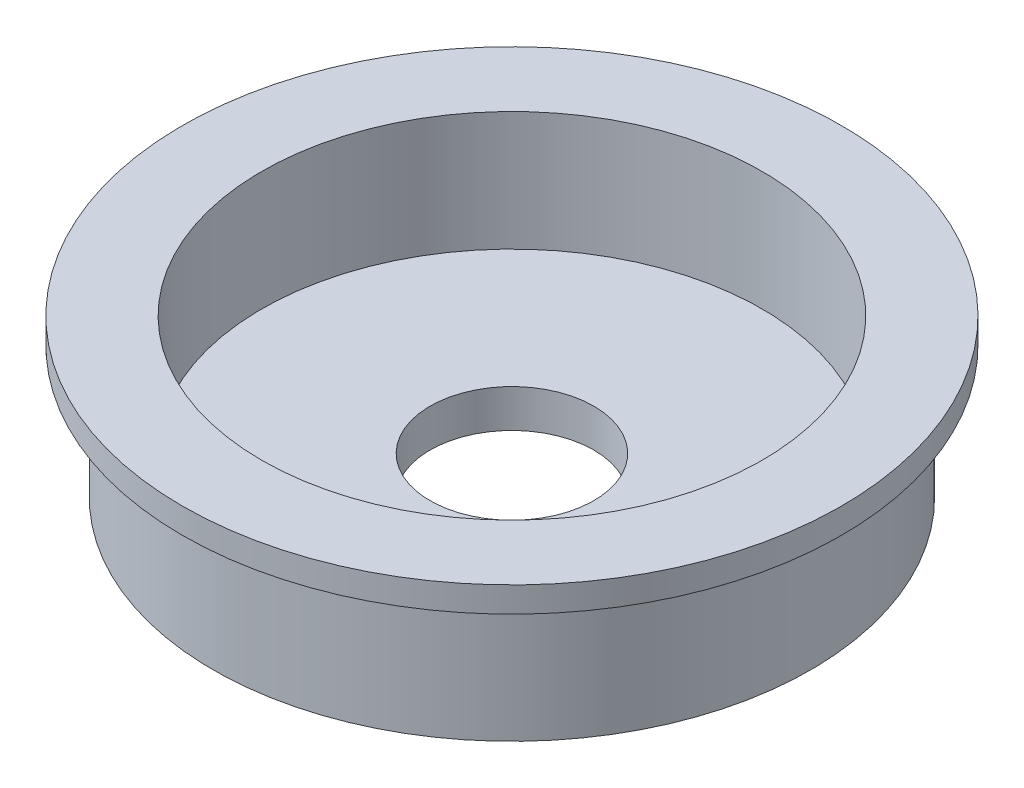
ISO-10303-21;
HEADER;
FILE_DESCRIPTION(('STEP AP214'),'2;1');
FILE_NAME('part.step','',(''),(''),'','','');
FILE_SCHEMA(('AUTOMOTIVE_DESIGN { 1 0 10303 214 1 1 1 1 }'));
ENDSEC;
DATA;
#1=APPLICATION_CONTEXT('core data for automotive mechanical design processes');
#2=APPLICATION_PROTOCOL_DEFINITION('international standard','automotive_design',2000,#1);
#3=PRODUCT_CONTEXT('',#1,'mechanical');
#4=PRODUCT('Part','Part','',(#3));
#5=PRODUCT_RELATED_PRODUCT_CATEGORY('part','',(#4));
#6=PRODUCT_DEFINITION_FORMATION('','',#4);
#7=PRODUCT_DEFINITION_CONTEXT('part definition',#1,'design');
#8=PRODUCT_DEFINITION('design','',#6,#7);
#9=PRODUCT_DEFINITION_SHAPE('','',#8);
#10=(LENGTH_UNIT() NAMED_UNIT(*) SI_UNIT(.MILLI.,.METRE.));
#11=(NAMED_UNIT(*) PLANE_ANGLE_UNIT() SI_UNIT($,.RADIAN.));
#12=(NAMED_UNIT(*) SI_UNIT($,.STERADIAN.) SOLID_ANGLE_UNIT());
#13=UNCERTAINTY_MEASURE_WITH_UNIT(LENGTH_MEASURE(1.E-05),#10,'distance_accuracy_value','');
#14=(GEOMETRIC_REPRESENTATION_CONTEXT(3) GLOBAL_UNCERTAINTY_ASSIGNED_CONTEXT((#13)) GLOBAL_UNIT_ASSIGNED_CONTEXT((#10,
#11,#12)) REPRESENTATION_CONTEXT('',''));
#15=CARTESIAN_POINT('',(0.,0.,0.));
#16=DIRECTION('',(0.,0.,1.));
#17=DIRECTION('',(1.,0.,0.));
#18=AXIS2_PLACEMENT_3D('',#15,#16,#17);
#19=CARTESIAN_POINT('',(0.,6.604,0.));
#20=DIRECTION('',(0.,-1.,0.));
#21=DIRECTION('',(0.,0.,-1.));
#22=AXIS2_PLACEMENT_3D('',#19,#20,#21);
#23=CYLINDRICAL_SURFACE('',#22,4.1021);
#24=CARTESIAN_POINT('',(0.,0.,0.));
#25=DIRECTION('',(0.,1.,0.));
#26=DIRECTION('',(0.,0.,1.));
#27=AXIS2_PLACEMENT_3D('',#24,#25,#26);
#28=CIRCLE('',#27,4.1021);
#29=CARTESIAN_POINT('',(0.,0.,-4.1021));
#30=VERTEX_POINT('',#29);
#31=EDGE_CURVE('E52',#30,#30,#28,.T.);
#32=CARTESIAN_POINT('',(0.,1.905,0.));
#33=DIRECTION('',(0.,1.,0.));
#34=DIRECTION('',(0.,0.,1.));
#35=AXIS2_PLACEMENT_3D('',#32,#33,#34);
#36=CIRCLE('',#35,4.1021);
#37=CARTESIAN_POINT('',(0.,1.905,-4.1021));
#38=VERTEX_POINT('',#37);
#39=EDGE_CURVE('E41',#38,#38,#36,.T.);
#40=CARTESIAN_POINT('',(0.,0.,-4.1021));
#41=CARTESIAN_POINT('',(0.,0.0198437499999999,-4.1021));
#42=CARTESIAN_POINT('',(0.,0.0396874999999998,-4.1021));
#43=CARTESIAN_POINT('',(0.,0.0793749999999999,-4.1021));
#44=CARTESIAN_POINT('',(0.,0.0992187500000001,-4.1021));
#45=CARTESIAN_POINT('',(0.,0.13890625,-4.1021));
#46=CARTESIAN_POINT('',(0.,0.15875,-4.1021));
#47=CARTESIAN_POINT('',(0.,0.1984375,-4.1021));
#48=CARTESIAN_POINT('',(0.,0.21828125,-4.1021));
#49=CARTESIAN_POINT('',(0.,0.25796875,-4.1021));
#50=CARTESIAN_POINT('',(0.,0.2778125,-4.1021));
#51=CARTESIAN_POINT('',(0.,0.3175,-4.1021));
#52=CARTESIAN_POINT('',(0.,0.33734375,-4.1021));
#53=CARTESIAN_POINT('',(0.,0.37703125,-4.1021));
#54=CARTESIAN_POINT('',(0.,0.396875,-4.1021));
#55=CARTESIAN_POINT('',(0.,0.436562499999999,-4.1021));
#56=CARTESIAN_POINT('',(0.,0.456406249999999,-4.1021));
#57=CARTESIAN_POINT('',(0.,0.496093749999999,-4.1021));
#58=CARTESIAN_POINT('',(0.,0.5159375,-4.1021));
#59=CARTESIAN_POINT('',(0.,0.555625,-4.1021));
#60=CARTESIAN_POINT('',(0.,0.57546875,-4.1021));
#61=CARTESIAN_POINT('',(0.,0.61515625,-4.1021));
#62=CARTESIAN_POINT('',(0.,0.635,-4.1021));
#63=CARTESIAN_POINT('',(0.,0.6746875,-4.1021));
#64=CARTESIAN_POINT('',(0.,0.69453125,-4.1021));
#65=CARTESIAN_POINT('',(0.,0.73421875,-4.1021));
#66=CARTESIAN_POINT('',(0.,0.7540625,-4.1021));
#67=CARTESIAN_POINT('',(0.,0.793749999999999,-4.1021));
#68=CARTESIAN_POINT('',(0.,0.813593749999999,-4.1021));
#69=CARTESIAN_POINT('',(0.,0.853281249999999,-4.1021));
#70=CARTESIAN_POINT('',(0.,0.873124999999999,-4.1021));
#71=CARTESIAN_POINT('',(0.,0.9128125,-4.1021));
#72=CARTESIAN_POINT('',(0.,0.932656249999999,-4.1021));
#73=CARTESIAN_POINT('',(0.,0.972343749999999,-4.1021));
#74=CARTESIAN_POINT('',(0.,0.992187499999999,-4.1021));
#75=CARTESIAN_POINT('',(0.,1.031875,-4.1021));
#76=CARTESIAN_POINT('',(0.,1.05171875,-4.1021));
#77=CARTESIAN_POINT('',(0.,1.09140625,-4.1021));
#78=CARTESIAN_POINT('',(0.,1.11125,-4.1021));
#79=CARTESIAN_POINT('',(0.,1.1509375,-4.1021));
#80=CARTESIAN_POINT('',(0.,1.17078125,-4.1021));
#81=CARTESIAN_POINT('',(0.,1.21046875,-4.1021));
#82=CARTESIAN_POINT('',(0.,1.2303125,-4.1021));
#83=CARTESIAN_POINT('',(0.,1.27,-4.1021));
#84=CARTESIAN_POINT('',(0.,1.28984375,-4.1021));
#85=CARTESIAN_POINT('',(0.,1.32953125,-4.1021));
#86=CARTESIAN_POINT('',(0.,1.349375,-4.1021));
#87=CARTESIAN_POINT('',(0.,1.3890625,-4.1021));
#88=CARTESIAN_POINT('',(0.,1.40890625,-4.1021));
#89=CARTESIAN_POINT('',(0.,1.44859375,-4.1021));
#90=CARTESIAN_POINT('',(0.,1.4684375,-4.1021));
#91=CARTESIAN_POINT('',(0.,1.508125,-4.1021));
#92=CARTESIAN_POINT('',(0.,1.52796875,-4.1021));
#93=CARTESIAN_POINT('',(0.,1.56765625,-4.1021));
#94=CARTESIAN_POINT('',(0.,1.5875,-4.1021));
#95=CARTESIAN_POINT('',(0.,1.6271875,-4.1021));
#96=CARTESIAN_POINT('',(0.,1.64703125,-4.1021));
#97=CARTESIAN_POINT('',(0.,1.68671875,-4.1021));
#98=CARTESIAN_POINT('',(0.,1.7065625,-4.1021));
#99=CARTESIAN_POINT('',(0.,1.74625,-4.1021));
#100=CARTESIAN_POINT('',(0.,1.76609375,-4.1021));
#101=CARTESIAN_POINT('',(0.,1.80578125,-4.1021));
#102=CARTESIAN_POINT('',(0.,1.825625,-4.1021));
#103=CARTESIAN_POINT('',(0.,1.8653125,-4.1021));
#104=CARTESIAN_POINT('',(0.,1.88515625,-4.1021));
#105=CARTESIAN_POINT('',(0.,1.905,-4.1021));
#106=B_SPLINE_CURVE_WITH_KNOTS('',3,(#40,#41,#42,#43,#44,#45,#46,#47,#48,#49,#50,#51,#52,#53,
#54,#55,#56,#57,#58,#59,#60,#61,#62,#63,#64,#65,#66,#67,#68,#69,#70,#71,#72,#73,#74,#75,#76,#77,
#78,#79,#80,#81,#82,#83,#84,#85,#86,#87,#88,#89,#90,#91,#92,#93,#94,#95,#96,#97,#98,#99,#100,
#101,#102,#103,#104,#105),.UNSPECIFIED.,.F.,.F.,(4,2,2,2,2,2,2,2,2,2,2,2,2,2,2,2,2,2,2,2,2,2,2,
2,2,2,2,2,2,2,2,2,4),(0.,0.0595312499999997,0.1190625,0.17859375,0.238125,0.29765625,0.3571875,
0.41671875,0.476249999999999,0.53578125,0.595312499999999,0.65484375,0.714375,0.773906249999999,
0.833437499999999,0.89296875,0.952499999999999,1.01203125,1.0715625,1.13109375,1.190625,
1.25015625,1.3096875,1.36921875,1.42875,1.48828125,1.5478125,1.60734375,1.666875,1.72640625,
1.7859375,1.84546875,1.905),.UNSPECIFIED.);
#107=EDGE_CURVE('BSEAM37',#30,#38,#106,.T.);
#108=ORIENTED_EDGE('',*,*,#31,.F.);
#109=ORIENTED_EDGE('',*,*,#39,.T.);
#110=ORIENTED_EDGE('',*,*,#107,.T.);
#111=ORIENTED_EDGE('',*,*,#107,.F.);
#112=EDGE_LOOP('',(#108,#110,#109,#111));
#113=FACE_BOUND('',#112,.T.);
#114=ADVANCED_FACE('F37',(#113),#23,.F.);
#115=CARTESIAN_POINT('',(0.,0.,0.));
#116=DIRECTION('',(0.,1.,0.));
#117=DIRECTION('',(0.,0.,1.));
#118=AXIS2_PLACEMENT_3D('',#115,#116,#117);
#119=PLANE('',#118);
#120=CARTESIAN_POINT('',(0.,0.,0.));
#121=DIRECTION('',(0.,1.,0.));
#122=DIRECTION('',(0.,0.,1.));
#123=AXIS2_PLACEMENT_3D('',#120,#121,#122);
#124=CIRCLE('',#123,14.9733);
#125=CARTESIAN_POINT('',(0.,0.,-14.9733));
#126=VERTEX_POINT('',#125);
#127=EDGE_CURVE('E46',#126,#126,#124,.T.);
#128=ORIENTED_EDGE('',*,*,#127,.F.);
#129=EDGE_LOOP('',(#128));
#130=FACE_BOUND('',#129,.T.);
#131=ORIENTED_EDGE('',*,*,#31,.T.);
#132=EDGE_LOOP('',(#131));
#133=FACE_BOUND('',#132,.T.);
#134=ADVANCED_FACE('F90',(#130,#133),#119,.F.);
#135=CARTESIAN_POINT('',(0.,6.604,0.));
#136=DIRECTION('',(0.,-1.,0.));
#137=DIRECTION('',(0.,0.,-1.));
#138=AXIS2_PLACEMENT_3D('',#135,#136,#137);
#139=CYLINDRICAL_SURFACE('',#138,14.9733);
#140=CARTESIAN_POINT('',(0.,6.604,0.));
#141=DIRECTION('',(0.,1.,0.));
#142=DIRECTION('',(0.,0.,1.));
#143=AXIS2_PLACEMENT_3D('',#140,#141,#142);
#144=CIRCLE('',#143,14.9733);
#145=CARTESIAN_POINT('',(0.,6.604,-14.9733));
#146=VERTEX_POINT('',#145);
#147=EDGE_CURVE('E10',#146,#146,#144,.T.);
#148=CARTESIAN_POINT('',(0.,6.604,-14.9733));
#149=CARTESIAN_POINT('',(0.,6.53520833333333,-14.9733));
#150=CARTESIAN_POINT('',(0.,6.46641666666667,-14.9733));
#151=CARTESIAN_POINT('',(0.,6.32883333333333,-14.9733));
#152=CARTESIAN_POINT('',(0.,6.26004166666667,-14.9733));
#153=CARTESIAN_POINT('',(0.,6.12245833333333,-14.9733));
#154=CARTESIAN_POINT('',(0.,6.05366666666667,-14.9733));
#155=CARTESIAN_POINT('',(0.,5.91608333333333,-14.9733));
#156=CARTESIAN_POINT('',(0.,5.84729166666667,-14.9733));
#157=CARTESIAN_POINT('',(0.,5.70970833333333,-14.9733));
#158=CARTESIAN_POINT('',(0.,5.64091666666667,-14.9733));
#159=CARTESIAN_POINT('',(0.,5.50333333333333,-14.9733));
#160=CARTESIAN_POINT('',(0.,5.43454166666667,-14.9733));
#161=CARTESIAN_POINT('',(0.,5.29695833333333,-14.9733));
#162=CARTESIAN_POINT('',(0.,5.22816666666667,-14.9733));
#163=CARTESIAN_POINT('',(0.,5.09058333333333,-14.9733));
#164=CARTESIAN_POINT('',(0.,5.02179166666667,-14.9733));
#165=CARTESIAN_POINT('',(0.,4.88420833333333,-14.9733));
#166=CARTESIAN_POINT('',(0.,4.81541666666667,-14.9733));
#167=CARTESIAN_POINT('',(0.,4.67783333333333,-14.9733));
#168=CARTESIAN_POINT('',(0.,4.60904166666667,-14.9733));
#169=CARTESIAN_POINT('',(0.,4.47145833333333,-14.9733));
#170=CARTESIAN_POINT('',(0.,4.40266666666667,-14.9733));
#171=CARTESIAN_POINT('',(0.,4.26508333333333,-14.9733));
#172=CARTESIAN_POINT('',(0.,4.19629166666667,-14.9733));
#173=CARTESIAN_POINT('',(0.,4.05870833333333,-14.9733));
#174=CARTESIAN_POINT('',(0.,3.98991666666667,-14.9733));
#175=CARTESIAN_POINT('',(0.,3.85233333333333,-14.9733));
#176=CARTESIAN_POINT('',(0.,3.78354166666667,-14.9733));
#177=CARTESIAN_POINT('',(0.,3.64595833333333,-14.9733));
#178=CARTESIAN_POINT('',(0.,3.57716666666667,-14.9733));
#179=CARTESIAN_POINT('',(0.,3.43958333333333,-14.9733));
#180=CARTESIAN_POINT('',(0.,3.37079166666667,-14.9733));
#181=CARTESIAN_POINT('',(0.,3.23320833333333,-14.9733));
#182=CARTESIAN_POINT('',(0.,3.16441666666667,-14.9733));
#183=CARTESIAN_POINT('',(0.,3.02683333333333,-14.9733));
#184=CARTESIAN_POINT('',(0.,2.95804166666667,-14.9733));
#185=CARTESIAN_POINT('',(0.,2.82045833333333,-14.9733));
#186=CARTESIAN_POINT('',(0.,2.75166666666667,-14.9733));
#187=CARTESIAN_POINT('',(0.,2.61408333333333,-14.9733));
#188=CARTESIAN_POINT('',(0.,2.54529166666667,-14.9733));
#189=CARTESIAN_POINT('',(0.,2.40770833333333,-14.9733));
#190=CARTESIAN_POINT('',(0.,2.33891666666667,-14.9733));
#191=CARTESIAN_POINT('',(0.,2.20133333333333,-14.9733));
#192=CARTESIAN_POINT('',(0.,2.13254166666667,-14.9733));
#193=CARTESIAN_POINT('',(0.,1.99495833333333,-14.9733));
#194=CARTESIAN_POINT('',(0.,1.92616666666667,-14.9733));
#195=CARTESIAN_POINT('',(0.,1.78858333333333,-14.9733));
#196=CARTESIAN_POINT('',(0.,1.71979166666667,-14.9733));
#197=CARTESIAN_POINT('',(0.,1.58220833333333,-14.9733));
#198=CARTESIAN_POINT('',(0.,1.51341666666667,-14.9733));
#199=CARTESIAN_POINT('',(0.,1.37583333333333,-14.9733));
#200=CARTESIAN_POINT('',(0.,1.30704166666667,-14.9733));
#201=CARTESIAN_POINT('',(0.,1.16945833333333,-14.9733));
#202=CARTESIAN_POINT('',(0.,1.10066666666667,-14.9733));
#203=CARTESIAN_POINT('',(0.,0.963083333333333,-14.9733));
#204=CARTESIAN_POINT('',(0.,0.894291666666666,-14.9733));
#205=CARTESIAN_POINT('',(0.,0.756708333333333,-14.9733));
#206=CARTESIAN_POINT('',(0.,0.687916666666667,-14.9733));
#207=CARTESIAN_POINT('',(0.,0.550333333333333,-14.9733));
#208=CARTESIAN_POINT('',(0.,0.481541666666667,-14.9733));
#209=CARTESIAN_POINT('',(0.,0.343958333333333,-14.9733));
#210=CARTESIAN_POINT('',(0.,0.275166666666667,-14.9733));
#211=CARTESIAN_POINT('',(0.,0.137583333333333,-14.9733));
#212=CARTESIAN_POINT('',(0.,0.0687916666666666,-14.9733));
#213=CARTESIAN_POINT('',(0.,0.,-14.9733));
#214=B_SPLINE_CURVE_WITH_KNOTS('',3,(#148,#149,#150,#151,#152,#153,#154,#155,#156,#157,#158,
#159,#160,#161,#162,#163,#164,#165,#166,#167,#168,#169,#170,#171,#172,#173,#174,#175,#176,#177,
#178,#179,#180,#181,#182,#183,#184,#185,#186,#187,#188,#189,#190,#191,#192,#193,#194,#195,#196,
#197,#198,#199,#200,#201,#202,#203,#204,#205,#206,#207,#208,#209,#210,#211,#212,#213),
.UNSPECIFIED.,.F.,.F.,(4,2,2,2,2,2,2,2,2,2,2,2,2,2,2,2,2,2,2,2,2,2,2,2,2,2,2,2,2,2,2,2,4),(0.,
0.206375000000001,0.412750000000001,0.619125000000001,0.825500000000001,1.031875,1.23825,
1.444625,1.651,1.857375,2.06375,2.270125,2.4765,2.682875,2.88925,3.095625,3.302,3.508375,
3.71475,3.921125,4.1275,4.333875,4.54025,4.746625,4.953,5.159375,5.36575,5.572125,5.7785,
5.984875,6.19125,6.397625,6.604),.UNSPECIFIED.);
#215=EDGE_CURVE('BSEAM39',#146,#126,#214,.T.);
#216=ORIENTED_EDGE('',*,*,#147,.F.);
#217=ORIENTED_EDGE('',*,*,#127,.T.);
#218=ORIENTED_EDGE('',*,*,#215,.T.);
#219=ORIENTED_EDGE('',*,*,#215,.F.);
#220=EDGE_LOOP('',(#216,#218,#217,#219));
#221=FACE_BOUND('',#220,.T.);
#222=ADVANCED_FACE('F39',(#221),#139,.T.);
#223=CARTESIAN_POINT('',(0.,7.874,0.));
#224=DIRECTION('',(0.,1.,0.));
#225=DIRECTION('',(0.,0.,1.));
#226=AXIS2_PLACEMENT_3D('',#223,#224,#225);
#227=PLANE('',#226);
#228=CARTESIAN_POINT('',(0.,7.874,0.));
#229=DIRECTION('',(0.,1.,0.));
#230=DIRECTION('',(0.,0.,1.));
#231=AXIS2_PLACEMENT_3D('',#228,#229,#230);
#232=CIRCLE('',#231,12.5349);
#233=CARTESIAN_POINT('',(0.,7.874,12.5349));
#234=VERTEX_POINT('',#233);
#235=EDGE_CURVE('E65',#234,#234,#232,.T.);
#236=ORIENTED_EDGE('',*,*,#235,.F.);
#237=EDGE_LOOP('',(#236));
#238=FACE_BOUND('',#237,.T.);
#239=CARTESIAN_POINT('',(0.,7.874,0.));
#240=DIRECTION('',(0.,1.,0.));
#241=DIRECTION('',(0.,0.,1.));
#242=AXIS2_PLACEMENT_3D('',#239,#240,#241);
#243=CIRCLE('',#242,16.51);
#244=CARTESIAN_POINT('',(0.,7.874,16.51));
#245=VERTEX_POINT('',#244);
#246=EDGE_CURVE('E57',#245,#245,#243,.T.);
#247=ORIENTED_EDGE('',*,*,#246,.T.);
#248=EDGE_LOOP('',(#247));
#249=FACE_BOUND('',#248,.T.);
#250=ADVANCED_FACE('F105',(#238,#249),#227,.T.);
#251=CARTESIAN_POINT('',(0.,6.604,0.));
#252=DIRECTION('',(0.,1.,0.));
#253=DIRECTION('',(0.,0.,1.));
#254=AXIS2_PLACEMENT_3D('',#251,#252,#253);
#255=PLANE('',#254);
#256=ORIENTED_EDGE('',*,*,#147,.T.);
#257=EDGE_LOOP('',(#256));
#258=FACE_BOUND('',#257,.T.);
#259=CARTESIAN_POINT('',(0.,6.604,0.));
#260=DIRECTION('',(0.,1.,0.));
#261=DIRECTION('',(0.,0.,1.));
#262=AXIS2_PLACEMENT_3D('',#259,#260,#261);
#263=CIRCLE('',#262,16.51);
#264=CARTESIAN_POINT('',(0.,6.604,16.51));
#265=VERTEX_POINT('',#264);
#266=EDGE_CURVE('E58',#265,#265,#263,.T.);
#267=ORIENTED_EDGE('',*,*,#266,.F.);
#268=EDGE_LOOP('',(#267));
#269=FACE_BOUND('',#268,.T.);
#270=ADVANCED_FACE('F101',(#258,#269),#255,.F.);
#271=CARTESIAN_POINT('',(0.,7.874,0.));
#272=DIRECTION('',(0.,-1.,0.));
#273=DIRECTION('',(0.,0.,-1.));
#274=AXIS2_PLACEMENT_3D('',#271,#272,#273);
#275=CYLINDRICAL_SURFACE('',#274,16.51);
#276=ORIENTED_EDGE('',*,*,#246,.F.);
#277=EDGE_LOOP('',(#276));
#278=FACE_BOUND('',#277,.T.);
#279=ORIENTED_EDGE('',*,*,#266,.T.);
#280=EDGE_LOOP('',(#279));
#281=FACE_BOUND('',#280,.T.);
#282=ADVANCED_FACE('F86',(#278,#281),#275,.T.);
#283=CARTESIAN_POINT('',(0.,1.905,0.));
#284=DIRECTION('',(0.,1.,0.));
#285=DIRECTION('',(0.,0.,1.));
#286=AXIS2_PLACEMENT_3D('',#283,#284,#285);
#287=CYLINDRICAL_SURFACE('',#286,12.5349);
#288=CARTESIAN_POINT('',(0.,1.905,0.));
#289=DIRECTION('',(0.,1.,0.));
#290=DIRECTION('',(0.,0.,1.));
#291=AXIS2_PLACEMENT_3D('',#288,#289,#290);
#292=CIRCLE('',#291,12.5349);
#293=CARTESIAN_POINT('',(0.,1.905,12.5349));
#294=VERTEX_POINT('',#293);
#295=EDGE_CURVE('E69',#294,#294,#292,.T.);
#296=ORIENTED_EDGE('',*,*,#295,.F.);
#297=EDGE_LOOP('',(#296));
#298=FACE_BOUND('',#297,.T.);
#299=ORIENTED_EDGE('',*,*,#235,.T.);
#300=EDGE_LOOP('',(#299));
#301=FACE_BOUND('',#300,.T.);
#302=ADVANCED_FACE('F81',(#298,#301),#287,.F.);
#303=CARTESIAN_POINT('',(0.,1.905,0.));
#304=DIRECTION('',(0.,1.,0.));
#305=DIRECTION('',(0.,0.,1.));
#306=AXIS2_PLACEMENT_3D('',#303,#304,#305);
#307=PLANE('',#306);
#308=ORIENTED_EDGE('',*,*,#39,.F.);
#309=EDGE_LOOP('',(#308));
#310=FACE_BOUND('',#309,.T.);
#311=ORIENTED_EDGE('',*,*,#295,.T.);
#312=EDGE_LOOP('',(#311));
#313=FACE_BOUND('',#312,.T.);
#314=ADVANCED_FACE('F79',(#310,#313),#307,.T.);
#315=CLOSED_SHELL('',(#114,#134,#222,#250,#270,#282,#302,#314));
#316=MANIFOLD_SOLID_BREP('B2',#315);
#317=ADVANCED_BREP_SHAPE_REPRESENTATION('',(#18,#316),#14);
#318=SHAPE_DEFINITION_REPRESENTATION(#9,#317);
ENDSEC;
END-ISO-10303-21;
